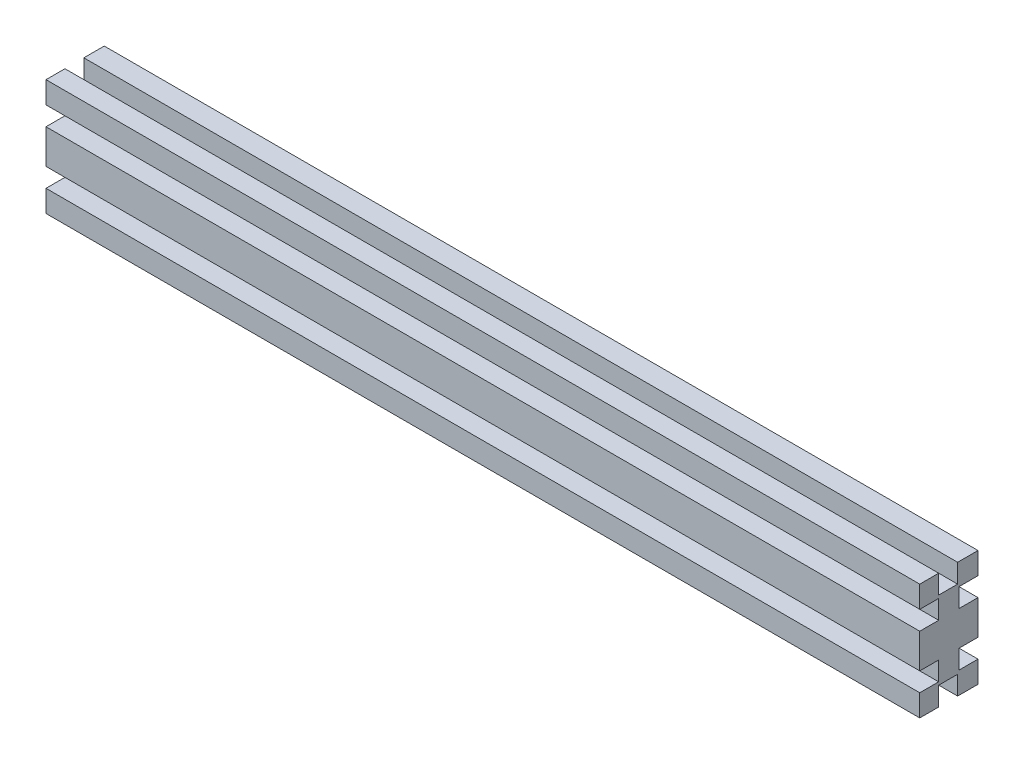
from build123d import *

# Parameters (mm, degrees)
EXTRUDE_1_DEPTH = 300


with BuildPart() as part:
    # Sketch 1 → Extrude 1 (new body)
    with BuildSketch(Plane(origin=(0, 0, 0), x_dir=(0, 0, -1), z_dir=(1, 0, 0))):
        Polygon((-10, 19.900686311), (-3.5, 19.900686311), (-3.5, 13.400686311), (3, 13.400686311), (3, 19.900686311), (10, 19.900686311), (10, 12.400686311), (3.5, 12.400686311), (3.5, 5.900686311), (10, 5.900686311), (10, -5.900686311), (3.5, -5.900686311), (3.5, -12.400686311), (10, -12.400686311), (10, -19.900686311), (3, -19.900686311), (3, -13.400686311), (-3.5, -13.400686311), (-3.5, -19.900686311), (-10, -19.900686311), (-10, -12.400686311), (-3.5, -12.400686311), (-3.5, -5.900686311), (-10, -5.900686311), (-10, 5.900686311), (-3.5, 5.900686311), (-3.5, 12.400686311), (-10, 12.400686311), align=None)
    extrude(amount=EXTRUDE_1_DEPTH)


solid = part.part
